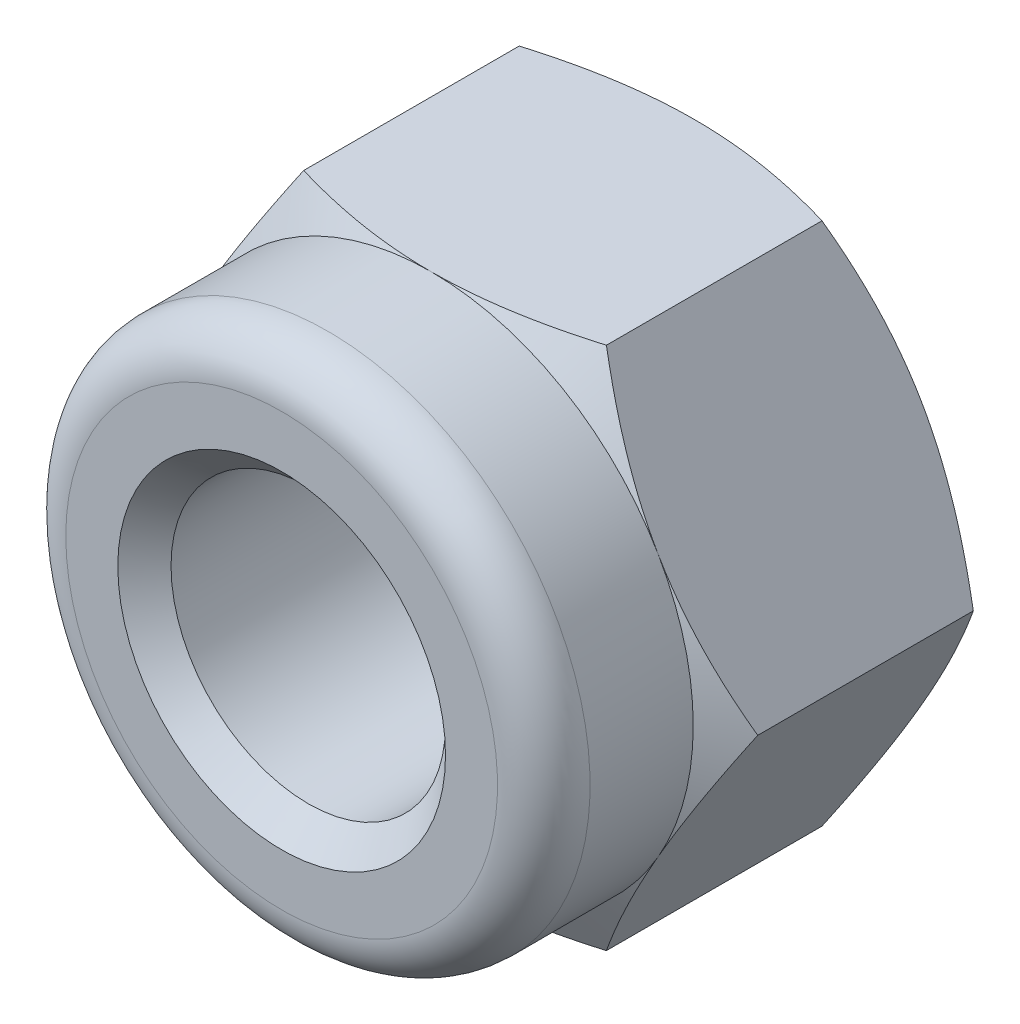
ISO-10303-21;
HEADER;
FILE_DESCRIPTION(('STEP AP214'),'2;1');
FILE_NAME('part.step','',(''),(''),'','','');
FILE_SCHEMA(('AUTOMOTIVE_DESIGN { 1 0 10303 214 1 1 1 1 }'));
ENDSEC;
DATA;
#1=APPLICATION_CONTEXT('core data for automotive mechanical design processes');
#2=APPLICATION_PROTOCOL_DEFINITION('international standard','automotive_design',2000,#1);
#3=PRODUCT_CONTEXT('',#1,'mechanical');
#4=PRODUCT('Part','Part','',(#3));
#5=PRODUCT_RELATED_PRODUCT_CATEGORY('part','',(#4));
#6=PRODUCT_DEFINITION_FORMATION('','',#4);
#7=PRODUCT_DEFINITION_CONTEXT('part definition',#1,'design');
#8=PRODUCT_DEFINITION('design','',#6,#7);
#9=PRODUCT_DEFINITION_SHAPE('','',#8);
#10=(LENGTH_UNIT() NAMED_UNIT(*) SI_UNIT(.MILLI.,.METRE.));
#11=(NAMED_UNIT(*) PLANE_ANGLE_UNIT() SI_UNIT($,.RADIAN.));
#12=(NAMED_UNIT(*) SI_UNIT($,.STERADIAN.) SOLID_ANGLE_UNIT());
#13=UNCERTAINTY_MEASURE_WITH_UNIT(LENGTH_MEASURE(1.E-05),#10,'distance_accuracy_value','');
#14=(GEOMETRIC_REPRESENTATION_CONTEXT(3) GLOBAL_UNCERTAINTY_ASSIGNED_CONTEXT((#13)) GLOBAL_UNIT_ASSIGNED_CONTEXT((#10,
#11,#12)) REPRESENTATION_CONTEXT('',''));
#15=CARTESIAN_POINT('',(0.,0.,0.));
#16=DIRECTION('',(0.,0.,1.));
#17=DIRECTION('',(1.,0.,0.));
#18=AXIS2_PLACEMENT_3D('',#15,#16,#17);
#19=CARTESIAN_POINT('',(-9.23760430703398,0.,8.04));
#20=DIRECTION('',(0.86602540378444,-0.499999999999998,0.));
#21=DIRECTION('',(0.499999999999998,0.86602540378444,0.));
#22=AXIS2_PLACEMENT_3D('',#19,#20,#21);
#23=PLANE('',#22);
#24=CARTESIAN_POINT('',(-9.23771977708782,-0.000199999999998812,7.30902271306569));
#25=CARTESIAN_POINT('',(-9.13598478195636,0.176010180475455,7.3690958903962));
#26=CARTESIAN_POINT('',(-9.03385362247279,0.352906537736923,7.42644748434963));
#27=CARTESIAN_POINT('',(-8.82872310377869,0.708203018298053,7.53494772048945));
#28=CARTESIAN_POINT('',(-8.72572337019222,0.886603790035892,7.5860935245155));
#29=CARTESIAN_POINT('',(-8.41499272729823,1.42480505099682,7.72921182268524));
#30=CARTESIAN_POINT('',(-8.20597720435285,1.7868305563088,7.81059421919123));
#31=CARTESIAN_POINT('',(-7.89322428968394,2.32853449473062,7.90585741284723));
#32=CARTESIAN_POINT('',(-7.79046603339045,2.50651701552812,7.93295207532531));
#33=CARTESIAN_POINT('',(-7.58446450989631,2.86332212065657,7.9783247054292));
#34=CARTESIAN_POINT('',(-7.48122128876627,3.04214462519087,7.996603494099));
#35=CARTESIAN_POINT('',(-7.27455287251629,3.40010482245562,8.023871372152));
#36=CARTESIAN_POINT('',(-7.17112804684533,3.57924187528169,8.03287163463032));
#37=CARTESIAN_POINT('',(-6.96418233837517,3.93768235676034,8.04138761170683));
#38=CARTESIAN_POINT('',(-6.86066145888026,4.11698577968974,8.04090364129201));
#39=CARTESIAN_POINT('',(-6.66763536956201,4.45131677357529,8.03116637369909));
#40=CARTESIAN_POINT('',(-6.5781147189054,4.60637108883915,8.02309933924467));
#41=CARTESIAN_POINT('',(-6.39929498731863,4.91609594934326,8.00003353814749));
#42=CARTESIAN_POINT('',(-6.30999592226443,5.07076646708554,7.98503428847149));
#43=CARTESIAN_POINT('',(-6.04246120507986,5.53415019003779,7.9299942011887));
#44=CARTESIAN_POINT('',(-5.86472281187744,5.84200211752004,7.8799184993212));
#45=CARTESIAN_POINT('',(-5.50728157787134,6.46110849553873,7.75491484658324));
#46=CARTESIAN_POINT('',(-5.32762833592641,6.77227703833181,7.67943904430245));
#47=CARTESIAN_POINT('',(-4.97111300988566,7.38977969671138,7.50831016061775));
#48=CARTESIAN_POINT('',(-4.79424593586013,7.69612245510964,7.41269898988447));
#49=CARTESIAN_POINT('',(-4.61868668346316,8.00020000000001,7.30902271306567));
#50=B_SPLINE_CURVE_WITH_KNOTS('',3,(#24,#25,#26,#27,#28,#29,#30,#31,#32,#33,#34,#35,#36,#37,#38,
#39,#40,#41,#42,#43,#44,#45,#46,#47,#48,#49),.UNSPECIFIED.,.F.,.F.,(4,2,2,2,2,2,2,2,2,2,2,2,4),
(0.,0.636405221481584,1.27310040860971,2.54928759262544,3.17101982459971,3.79269414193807,
4.41361896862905,5.03452317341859,5.57205298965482,6.10962026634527,7.18556169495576,
8.28638054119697,9.38493034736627),.UNSPECIFIED.);
#51=CARTESIAN_POINT('',(-9.23760430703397,0.,7.3090909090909));
#52=VERTEX_POINT('',#51);
#53=CARTESIAN_POINT('',(-6.92820323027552,3.99999999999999,8.04));
#54=VERTEX_POINT('',#53);
#55=EDGE_CURVE('E140',#52,#54,#50,.T.);
#56=ORIENTED_EDGE('',*,*,#55,.T.);
#57=CARTESIAN_POINT('',(-4.61880215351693,8.00000000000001,7.3090909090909));
#58=VERTEX_POINT('',#57);
#59=EDGE_CURVE('E212',#54,#58,#50,.T.);
#60=ORIENTED_EDGE('',*,*,#59,.T.);
#61=DIRECTION('',(0.,0.,-1.));
#62=VECTOR('',#61,1.);
#63=CARTESIAN_POINT('',(-4.618802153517,8.00000000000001,8.04));
#64=LINE('',#63,#62);
#65=CARTESIAN_POINT('',(-4.618802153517,8.00000000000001,0.730909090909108));
#66=VERTEX_POINT('',#65);
#67=EDGE_CURVE('E284',#58,#66,#64,.T.);
#68=ORIENTED_EDGE('',*,*,#67,.T.);
#69=CARTESIAN_POINT('',(-4.61868668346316,8.00020000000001,0.730977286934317));
#70=CARTESIAN_POINT('',(-4.72042167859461,7.82398981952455,0.670904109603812));
#71=CARTESIAN_POINT('',(-4.82255283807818,7.64709346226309,0.613552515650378));
#72=CARTESIAN_POINT('',(-5.02768335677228,7.29179698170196,0.505052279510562));
#73=CARTESIAN_POINT('',(-5.13068309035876,7.11339620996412,0.453906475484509));
#74=CARTESIAN_POINT('',(-5.44141373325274,6.57519494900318,0.310788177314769));
#75=CARTESIAN_POINT('',(-5.65042925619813,6.2131694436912,0.229405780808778));
#76=CARTESIAN_POINT('',(-5.96318217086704,5.67146550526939,0.134142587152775));
#77=CARTESIAN_POINT('',(-6.06594042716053,5.49348298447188,0.107047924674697));
#78=CARTESIAN_POINT('',(-6.27194195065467,5.13667787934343,0.0616752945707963));
#79=CARTESIAN_POINT('',(-6.37518517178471,4.95785537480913,0.0433965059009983));
#80=CARTESIAN_POINT('',(-6.58185358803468,4.59989517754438,0.0161286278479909));
#81=CARTESIAN_POINT('',(-6.68527841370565,4.42075812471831,0.00712836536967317));
#82=CARTESIAN_POINT('',(-6.89222412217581,4.06231764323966,-0.00138761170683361));
#83=CARTESIAN_POINT('',(-6.99574500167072,3.88301422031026,-0.000903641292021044));
#84=CARTESIAN_POINT('',(-7.18877109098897,3.54868322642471,0.00883362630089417));
#85=CARTESIAN_POINT('',(-7.27829174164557,3.39362891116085,0.016900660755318));
#86=CARTESIAN_POINT('',(-7.45711147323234,3.08390405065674,0.0399664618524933));
#87=CARTESIAN_POINT('',(-7.54641053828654,2.92923353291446,0.0549657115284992));
#88=CARTESIAN_POINT('',(-7.81394525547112,2.46584980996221,0.110005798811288));
#89=CARTESIAN_POINT('',(-7.99168364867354,2.15799788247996,0.160081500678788));
#90=CARTESIAN_POINT('',(-8.34912488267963,1.53889150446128,0.285085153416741));
#91=CARTESIAN_POINT('',(-8.52877812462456,1.2277229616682,0.360560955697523));
#92=CARTESIAN_POINT('',(-8.88529345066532,0.610220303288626,0.531689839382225));
#93=CARTESIAN_POINT('',(-9.06216052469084,0.303877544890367,0.627301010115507));
#94=CARTESIAN_POINT('',(-9.23771977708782,-0.000199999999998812,0.730977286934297));
#95=B_SPLINE_CURVE_WITH_KNOTS('',3,(#69,#70,#71,#72,#73,#74,#75,#76,#77,#78,#79,#80,#81,#82,#83,
#84,#85,#86,#87,#88,#89,#90,#91,#92,#93,#94),.UNSPECIFIED.,.F.,.F.,(4,2,2,2,2,2,2,2,2,2,2,2,4),
(0.,0.636405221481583,1.27310040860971,2.54928759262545,3.17101982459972,3.79269414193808,
4.41361896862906,5.03452317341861,5.57205298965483,6.10962026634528,7.18556169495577,
8.28638054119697,9.38493034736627),.UNSPECIFIED.);
#96=CARTESIAN_POINT('',(-6.92820323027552,3.99999999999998,0.));
#97=VERTEX_POINT('',#96);
#98=EDGE_CURVE('E283',#66,#97,#95,.T.);
#99=ORIENTED_EDGE('',*,*,#98,.T.);
#100=CARTESIAN_POINT('',(-9.23760430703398,0.,0.730909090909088));
#101=VERTEX_POINT('',#100);
#102=EDGE_CURVE('E278',#97,#101,#95,.T.);
#103=ORIENTED_EDGE('',*,*,#102,.T.);
#104=DIRECTION('',(0.,0.,-1.));
#105=VECTOR('',#104,1.);
#106=CARTESIAN_POINT('',(-9.23760430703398,0.,8.04));
#107=LINE('',#106,#105);
#108=EDGE_CURVE('E215',#52,#101,#107,.T.);
#109=ORIENTED_EDGE('',*,*,#108,.F.);
#110=EDGE_LOOP('',(#56,#60,#68,#99,#103,#109));
#111=FACE_BOUND('',#110,.T.);
#112=ADVANCED_FACE('F30',(#111),#23,.F.);
#113=CARTESIAN_POINT('',(-4.61880215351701,-8.,8.04));
#114=DIRECTION('',(0.866025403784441,0.499999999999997,0.));
#115=DIRECTION('',(-0.499999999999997,0.866025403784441,0.));
#116=AXIS2_PLACEMENT_3D('',#113,#114,#115);
#117=PLANE('',#116);
#118=CARTESIAN_POINT('',(-4.61868668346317,-8.0002,7.30902271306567));
#119=CARTESIAN_POINT('',(-4.72042167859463,-7.82398981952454,7.36909589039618));
#120=CARTESIAN_POINT('',(-4.8225528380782,-7.64709346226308,7.42644748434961));
#121=CARTESIAN_POINT('',(-5.02768335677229,-7.29179698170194,7.53494772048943));
#122=CARTESIAN_POINT('',(-5.13068309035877,-7.11339620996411,7.58609352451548));
#123=CARTESIAN_POINT('',(-5.44141373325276,-6.57519494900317,7.72921182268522));
#124=CARTESIAN_POINT('',(-5.65042925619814,-6.21316944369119,7.81059421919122));
#125=CARTESIAN_POINT('',(-5.96318217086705,-5.67146550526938,7.90585741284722));
#126=CARTESIAN_POINT('',(-6.06594042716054,-5.49348298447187,7.93295207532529));
#127=CARTESIAN_POINT('',(-6.27194195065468,-5.13667787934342,7.97832470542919));
#128=CARTESIAN_POINT('',(-6.37518517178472,-4.95785537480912,7.99660349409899));
#129=CARTESIAN_POINT('',(-6.58185358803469,-4.59989517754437,8.023871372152));
#130=CARTESIAN_POINT('',(-6.68527841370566,-4.4207581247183,8.03287163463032));
#131=CARTESIAN_POINT('',(-6.89222412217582,-4.06231764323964,8.04138761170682));
#132=CARTESIAN_POINT('',(-6.99574500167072,-3.88301422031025,8.04090364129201));
#133=CARTESIAN_POINT('',(-7.18877109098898,-3.5486832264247,8.03116637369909));
#134=CARTESIAN_POINT('',(-7.27829174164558,-3.39362891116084,8.02309933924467));
#135=CARTESIAN_POINT('',(-7.45711147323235,-3.08390405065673,8.0000335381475));
#136=CARTESIAN_POINT('',(-7.54641053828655,-2.92923353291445,7.98503428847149));
#137=CARTESIAN_POINT('',(-7.81394525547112,-2.4658498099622,7.9299942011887));
#138=CARTESIAN_POINT('',(-7.99168364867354,-2.15799788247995,7.8799184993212));
#139=CARTESIAN_POINT('',(-8.34912488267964,-1.53889150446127,7.75491484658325));
#140=CARTESIAN_POINT('',(-8.52877812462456,-1.22772296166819,7.67943904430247));
#141=CARTESIAN_POINT('',(-8.88529345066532,-0.610220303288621,7.50831016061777));
#142=CARTESIAN_POINT('',(-9.06216052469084,-0.303877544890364,7.41269898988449));
#143=CARTESIAN_POINT('',(-9.23771977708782,0.000199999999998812,7.30902271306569));
#144=B_SPLINE_CURVE_WITH_KNOTS('',3,(#118,#119,#120,#121,#122,#123,#124,#125,#126,#127,#128,
#129,#130,#131,#132,#133,#134,#135,#136,#137,#138,#139,#140,#141,#142,#143),.UNSPECIFIED.,.F.,
.F.,(4,2,2,2,2,2,2,2,2,2,2,2,4),(0.,0.636405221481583,1.27310040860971,2.54928759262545,
3.17101982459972,3.79269414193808,4.41361896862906,5.03452317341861,5.57205298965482,
6.10962026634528,7.18556169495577,8.28638054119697,9.38493034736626),.UNSPECIFIED.);
#145=CARTESIAN_POINT('',(-4.61880215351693,-8.00000000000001,7.3090909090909));
#146=VERTEX_POINT('',#145);
#147=CARTESIAN_POINT('',(-6.92820323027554,-3.99999999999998,8.04));
#148=VERTEX_POINT('',#147);
#149=EDGE_CURVE('E122',#146,#148,#144,.T.);
#150=ORIENTED_EDGE('',*,*,#149,.T.);
#151=EDGE_CURVE('E125',#148,#52,#144,.T.);
#152=ORIENTED_EDGE('',*,*,#151,.T.);
#153=ORIENTED_EDGE('',*,*,#108,.T.);
#154=CARTESIAN_POINT('',(-9.23771977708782,0.000199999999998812,0.730977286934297));
#155=CARTESIAN_POINT('',(-9.13598478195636,-0.176010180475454,0.670904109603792));
#156=CARTESIAN_POINT('',(-9.03385362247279,-0.352906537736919,0.613552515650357));
#157=CARTESIAN_POINT('',(-8.82872310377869,-0.708203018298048,0.505052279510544));
#158=CARTESIAN_POINT('',(-8.72572337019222,-0.886603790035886,0.453906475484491));
#159=CARTESIAN_POINT('',(-8.41499272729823,-1.42480505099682,0.310788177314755));
#160=CARTESIAN_POINT('',(-8.20597720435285,-1.7868305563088,0.229405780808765));
#161=CARTESIAN_POINT('',(-7.89322428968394,-2.32853449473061,0.134142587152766));
#162=CARTESIAN_POINT('',(-7.79046603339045,-2.50651701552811,0.107047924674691));
#163=CARTESIAN_POINT('',(-7.58446450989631,-2.86332212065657,0.061675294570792));
#164=CARTESIAN_POINT('',(-7.48122128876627,-3.04214462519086,0.0433965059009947));
#165=CARTESIAN_POINT('',(-7.2745528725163,-3.40010482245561,0.016128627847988));
#166=CARTESIAN_POINT('',(-7.17112804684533,-3.57924187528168,0.00712836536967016));
#167=CARTESIAN_POINT('',(-6.96418233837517,-3.93768235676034,-0.00138761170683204));
#168=CARTESIAN_POINT('',(-6.86066145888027,-4.11698577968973,-0.000903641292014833));
#169=CARTESIAN_POINT('',(-6.66763536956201,-4.45131677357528,0.00883362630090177));
#170=CARTESIAN_POINT('',(-6.57811471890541,-4.60637108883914,0.0169006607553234));
#171=CARTESIAN_POINT('',(-6.39929498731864,-4.91609594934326,0.0399664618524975));
#172=CARTESIAN_POINT('',(-6.30999592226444,-5.07076646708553,0.0549657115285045));
#173=CARTESIAN_POINT('',(-6.04246120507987,-5.53415019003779,0.110005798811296));
#174=CARTESIAN_POINT('',(-5.86472281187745,-5.84200211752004,0.160081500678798));
#175=CARTESIAN_POINT('',(-5.50728157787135,-6.46110849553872,0.285085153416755));
#176=CARTESIAN_POINT('',(-5.32762833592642,-6.7722770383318,0.360560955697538));
#177=CARTESIAN_POINT('',(-4.97111300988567,-7.38977969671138,0.531689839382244));
#178=CARTESIAN_POINT('',(-4.79424593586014,-7.69612245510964,0.627301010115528));
#179=CARTESIAN_POINT('',(-4.61868668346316,-8.0002,0.730977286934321));
#180=B_SPLINE_CURVE_WITH_KNOTS('',3,(#154,#155,#156,#157,#158,#159,#160,#161,#162,#163,#164,
#165,#166,#167,#168,#169,#170,#171,#172,#173,#174,#175,#176,#177,#178,#179),.UNSPECIFIED.,.F.,
.F.,(4,2,2,2,2,2,2,2,2,2,2,2,4),(0.,0.63640522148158,1.2731004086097,2.54928759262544,
3.17101982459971,3.79269414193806,4.41361896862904,5.03452317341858,5.57205298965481,
6.10962026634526,7.18556169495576,8.28638054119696,9.38493034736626),.UNSPECIFIED.);
#181=CARTESIAN_POINT('',(-6.92820323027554,-3.99999999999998,0.));
#182=VERTEX_POINT('',#181);
#183=EDGE_CURVE('E272',#101,#182,#180,.T.);
#184=ORIENTED_EDGE('',*,*,#183,.T.);
#185=CARTESIAN_POINT('',(-4.61880215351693,-8.00000000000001,0.730909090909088));
#186=VERTEX_POINT('',#185);
#187=EDGE_CURVE('E266',#182,#186,#180,.T.);
#188=ORIENTED_EDGE('',*,*,#187,.T.);
#189=DIRECTION('',(0.,0.,-1.));
#190=VECTOR('',#189,1.);
#191=CARTESIAN_POINT('',(-4.61880215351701,-8.,8.04));
#192=LINE('',#191,#190);
#193=EDGE_CURVE('E128',#146,#186,#192,.T.);
#194=ORIENTED_EDGE('',*,*,#193,.F.);
#195=EDGE_LOOP('',(#150,#152,#153,#184,#188,#194));
#196=FACE_BOUND('',#195,.T.);
#197=ADVANCED_FACE('F124',(#196),#117,.F.);
#198=CARTESIAN_POINT('',(4.618802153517,-8.,8.04));
#199=DIRECTION('',(0.,1.,0.));
#200=DIRECTION('',(-1.,0.,0.));
#201=AXIS2_PLACEMENT_3D('',#198,#199,#200);
#202=PLANE('',#201);
#203=CARTESIAN_POINT('',(-12.2494480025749,-8.,4.1241854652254));
#204=CARTESIAN_POINT('',(-11.8988966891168,-8.,4.29747281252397));
#205=CARTESIAN_POINT('',(-11.5474876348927,-7.99999999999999,4.46905638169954));
#206=CARTESIAN_POINT('',(-10.8424887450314,-7.99999999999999,4.80784022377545));
#207=CARTESIAN_POINT('',(-10.4888985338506,-7.99999999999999,4.97503971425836));
#208=CARTESIAN_POINT('',(-9.77708168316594,-7.99999999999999,5.30499759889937));
#209=CARTESIAN_POINT('',(-9.41883997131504,-7.99999999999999,5.46772359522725));
#210=CARTESIAN_POINT('',(-8.69930316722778,-7.99999999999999,5.78625102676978));
#211=CARTESIAN_POINT('',(-8.33800824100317,-8.,5.94205283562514));
#212=CARTESIAN_POINT('',(-7.6068605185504,-8.,6.24690528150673));
#213=CARTESIAN_POINT('',(-7.23695794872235,-8.,6.39583720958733));
#214=CARTESIAN_POINT('',(-6.49261235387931,-8.,6.68211017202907));
#215=CARTESIAN_POINT('',(-6.11816880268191,-8.,6.8194498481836));
#216=CARTESIAN_POINT('',(-5.36490469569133,-8.,7.07882342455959));
#217=CARTESIAN_POINT('',(-4.98609591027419,-7.99999999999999,7.20089113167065));
#218=CARTESIAN_POINT('',(-4.22286609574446,-8.,7.42573868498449));
#219=CARTESIAN_POINT('',(-3.83844697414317,-8.00000000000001,7.52852492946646));
#220=CARTESIAN_POINT('',(-3.06363739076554,-8.00000000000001,7.70975510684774));
#221=CARTESIAN_POINT('',(-2.67324528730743,-8.,7.78819221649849));
#222=CARTESIAN_POINT('',(-2.08406130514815,-8.,7.88359074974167));
#223=CARTESIAN_POINT('',(-1.88704386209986,-8.,7.91168274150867));
#224=CARTESIAN_POINT('',(-1.49204151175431,-8.,7.95988434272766));
#225=CARTESIAN_POINT('',(-1.29405670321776,-8.,7.97999475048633));
#226=CARTESIAN_POINT('',(-0.89875005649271,-8.,8.01167549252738));
#227=CARTESIAN_POINT('',(-0.701432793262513,-8.,8.02330267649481));
#228=CARTESIAN_POINT('',(-0.306479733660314,-8.,8.03796692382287));
#229=CARTESIAN_POINT('',(-0.108843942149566,-8.,8.04100411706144));
#230=CARTESIAN_POINT('',(0.286318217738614,-8.,8.03841459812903));
#231=CARTESIAN_POINT('',(0.48384460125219,-8.,8.03279022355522));
#232=CARTESIAN_POINT('',(0.878473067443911,-8.,8.01301944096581));
#233=CARTESIAN_POINT('',(1.0755751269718,-8.00000000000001,7.99887257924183));
#234=CARTESIAN_POINT('',(1.54507610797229,-8.00000000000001,7.95531775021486));
#235=CARTESIAN_POINT('',(1.81712981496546,-8.,7.92212443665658));
#236=CARTESIAN_POINT('',(2.35907056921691,-8.,7.84129845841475));
#237=CARTESIAN_POINT('',(2.62895731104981,-8.,7.79366379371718));
#238=CARTESIAN_POINT('',(3.43581091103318,-8.,7.63139306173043));
#239=CARTESIAN_POINT('',(3.96895108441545,-8.,7.49749627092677));
#240=CARTESIAN_POINT('',(4.7664231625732,-8.,7.26673981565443));
#241=CARTESIAN_POINT('',(5.03498549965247,-8.,7.18368674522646));
#242=CARTESIAN_POINT('',(5.56946017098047,-8.,7.00930187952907));
#243=CARTESIAN_POINT('',(5.8353722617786,-8.,6.91796933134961));
#244=CARTESIAN_POINT('',(6.36324568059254,-8.,6.72894447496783));
#245=CARTESIAN_POINT('',(6.62522071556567,-8.,6.63129006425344));
#246=CARTESIAN_POINT('',(7.14687665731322,-8.,6.4302871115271));
#247=CARTESIAN_POINT('',(7.40655833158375,-8.,6.32694056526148));
#248=CARTESIAN_POINT('',(7.66526843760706,-8.00000000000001,6.22126991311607));
#249=B_SPLINE_CURVE_WITH_KNOTS('',3,(#203,#204,#205,#206,#207,#208,#209,#210,#211,#212,#213,
#214,#215,#216,#217,#218,#219,#220,#221,#222,#223,#224,#225,#226,#227,#228,#229,#230,#231,#232,
#233,#234,#235,#236,#237,#238,#239,#240,#241,#242,#243,#244,#245,#246,#247,#248),.UNSPECIFIED.,
.F.,.F.,(4,2,2,2,2,2,2,2,2,2,2,2,2,2,2,2,2,2,2,2,2,2,4),(0.,1.17314553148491,2.34649902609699,
3.52684382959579,4.70712486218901,5.90325054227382,7.09951617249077,8.29308497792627,
9.48625701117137,10.6797631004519,11.2766571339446,11.8734914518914,12.4662884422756,
13.0590764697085,13.6517045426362,14.2443641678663,15.0661167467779,15.8879831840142,
17.5347791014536,18.3780442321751,19.221386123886,20.0600717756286,20.898465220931),.UNSPECIFIED.);
#250=CARTESIAN_POINT('',(4.61880215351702,-7.99999999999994,7.3090909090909));
#251=VERTEX_POINT('',#250);
#252=CARTESIAN_POINT('',(0.,-8.,8.04));
#253=VERTEX_POINT('',#252);
#254=EDGE_CURVE('E357',#251,#253,#249,.F.);
#255=ORIENTED_EDGE('',*,*,#254,.T.);
#256=EDGE_CURVE('E145',#253,#146,#249,.F.);
#257=ORIENTED_EDGE('',*,*,#256,.T.);
#258=ORIENTED_EDGE('',*,*,#193,.T.);
#259=CARTESIAN_POINT('',(-12.2494480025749,-7.99999999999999,3.91581453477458));
#260=CARTESIAN_POINT('',(-11.8988966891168,-7.99999999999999,3.74252718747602));
#261=CARTESIAN_POINT('',(-11.5474876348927,-7.99999999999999,3.57094361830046));
#262=CARTESIAN_POINT('',(-10.8424887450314,-7.99999999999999,3.23215977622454));
#263=CARTESIAN_POINT('',(-10.4888985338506,-7.99999999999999,3.06496028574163));
#264=CARTESIAN_POINT('',(-9.77708168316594,-7.99999999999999,2.73500240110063));
#265=CARTESIAN_POINT('',(-9.41883997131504,-7.99999999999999,2.57227640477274));
#266=CARTESIAN_POINT('',(-8.69930316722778,-7.99999999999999,2.25374897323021));
#267=CARTESIAN_POINT('',(-8.33800824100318,-8.,2.09794716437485));
#268=CARTESIAN_POINT('',(-7.60686051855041,-8.,1.79309471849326));
#269=CARTESIAN_POINT('',(-7.23695794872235,-8.,1.64416279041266));
#270=CARTESIAN_POINT('',(-6.49261235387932,-8.,1.35788982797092));
#271=CARTESIAN_POINT('',(-6.11816880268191,-8.,1.22055015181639));
#272=CARTESIAN_POINT('',(-5.36490469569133,-8.,0.961176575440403));
#273=CARTESIAN_POINT('',(-4.98609591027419,-8.,0.83910886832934));
#274=CARTESIAN_POINT('',(-4.22286609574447,-7.99999999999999,0.614261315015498));
#275=CARTESIAN_POINT('',(-3.83844697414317,-7.99999999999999,0.511475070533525));
#276=CARTESIAN_POINT('',(-3.06363739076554,-7.99999999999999,0.330244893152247));
#277=CARTESIAN_POINT('',(-2.67324528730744,-8.,0.251807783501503));
#278=CARTESIAN_POINT('',(-2.08406130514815,-8.,0.15640925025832));
#279=CARTESIAN_POINT('',(-1.88704386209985,-8.,0.128317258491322));
#280=CARTESIAN_POINT('',(-1.49204151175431,-8.,0.0801156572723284));
#281=CARTESIAN_POINT('',(-1.29405670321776,-8.,0.0600052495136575));
#282=CARTESIAN_POINT('',(-0.898750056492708,-8.,0.0283245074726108));
#283=CARTESIAN_POINT('',(-0.701432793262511,-8.,0.0166973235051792));
#284=CARTESIAN_POINT('',(-0.306479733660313,-8.,0.00203307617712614));
#285=CARTESIAN_POINT('',(-0.108843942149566,-8.,-0.00100411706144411));
#286=CARTESIAN_POINT('',(0.286318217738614,-8.,0.00158540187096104));
#287=CARTESIAN_POINT('',(0.48384460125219,-8.,0.00720977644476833));
#288=CARTESIAN_POINT('',(0.878473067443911,-8.,0.0269805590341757));
#289=CARTESIAN_POINT('',(1.0755751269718,-8.00000000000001,0.0411274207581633));
#290=CARTESIAN_POINT('',(1.54507610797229,-8.00000000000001,0.0846822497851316));
#291=CARTESIAN_POINT('',(1.81712981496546,-8.,0.117875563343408));
#292=CARTESIAN_POINT('',(2.35907056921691,-8.,0.198701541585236));
#293=CARTESIAN_POINT('',(2.62895731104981,-8.,0.24633620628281));
#294=CARTESIAN_POINT('',(3.43581091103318,-8.,0.408606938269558));
#295=CARTESIAN_POINT('',(3.96895108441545,-8.,0.542503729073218));
#296=CARTESIAN_POINT('',(4.7664231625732,-8.,0.773260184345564));
#297=CARTESIAN_POINT('',(5.03498549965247,-8.,0.856313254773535));
#298=CARTESIAN_POINT('',(5.56946017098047,-8.,1.03069812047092));
#299=CARTESIAN_POINT('',(5.8353722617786,-8.,1.12203066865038));
#300=CARTESIAN_POINT('',(6.36324568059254,-8.,1.31105552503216));
#301=CARTESIAN_POINT('',(6.62522071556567,-8.,1.40870993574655));
#302=CARTESIAN_POINT('',(7.14687665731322,-8.,1.60971288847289));
#303=CARTESIAN_POINT('',(7.40655833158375,-8.,1.71305943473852));
#304=CARTESIAN_POINT('',(7.66526843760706,-8.,1.81873008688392));
#305=B_SPLINE_CURVE_WITH_KNOTS('',3,(#259,#260,#261,#262,#263,#264,#265,#266,#267,#268,#269,
#270,#271,#272,#273,#274,#275,#276,#277,#278,#279,#280,#281,#282,#283,#284,#285,#286,#287,#288,
#289,#290,#291,#292,#293,#294,#295,#296,#297,#298,#299,#300,#301,#302,#303,#304),.UNSPECIFIED.,
.F.,.F.,(4,2,2,2,2,2,2,2,2,2,2,2,2,2,2,2,2,2,2,2,2,2,4),(0.,1.17314553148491,2.34649902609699,
3.52684382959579,4.707124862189,5.90325054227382,7.09951617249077,8.29308497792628,
9.48625701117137,10.6797631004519,11.2766571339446,11.8734914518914,12.4662884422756,
13.0590764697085,13.6517045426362,14.2443641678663,15.0661167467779,15.8879831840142,
17.5347791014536,18.3780442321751,19.221386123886,20.0600717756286,20.898465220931),.UNSPECIFIED.);
#306=CARTESIAN_POINT('',(0.,-8.,0.));
#307=VERTEX_POINT('',#306);
#308=EDGE_CURVE('E273',#186,#307,#305,.T.);
#309=ORIENTED_EDGE('',*,*,#308,.T.);
#310=CARTESIAN_POINT('',(4.61880215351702,-7.99999999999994,0.730909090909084));
#311=VERTEX_POINT('',#310);
#312=EDGE_CURVE('E53',#307,#311,#305,.T.);
#313=ORIENTED_EDGE('',*,*,#312,.T.);
#314=DIRECTION('',(0.,0.,-1.));
#315=VECTOR('',#314,1.);
#316=CARTESIAN_POINT('',(4.618802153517,-8.,8.04));
#317=LINE('',#316,#315);
#318=EDGE_CURVE('E290',#251,#311,#317,.T.);
#319=ORIENTED_EDGE('',*,*,#318,.F.);
#320=EDGE_LOOP('',(#255,#257,#258,#309,#313,#319));
#321=FACE_BOUND('',#320,.T.);
#322=ADVANCED_FACE('F210',(#321),#202,.F.);
#323=CARTESIAN_POINT('',(9.23760430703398,0.,8.04));
#324=DIRECTION('',(-0.86602540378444,0.499999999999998,0.));
#325=DIRECTION('',(-0.499999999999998,-0.86602540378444,0.));
#326=AXIS2_PLACEMENT_3D('',#323,#324,#325);
#327=PLANE('',#326);
#328=CARTESIAN_POINT('',(9.23771977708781,0.000200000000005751,7.30902271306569));
#329=CARTESIAN_POINT('',(9.13598478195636,-0.176010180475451,7.3690958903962));
#330=CARTESIAN_POINT('',(9.03385362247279,-0.352906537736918,7.42644748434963));
#331=CARTESIAN_POINT('',(8.82872310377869,-0.708203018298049,7.53494772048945));
#332=CARTESIAN_POINT('',(8.72572337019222,-0.886603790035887,7.5860935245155));
#333=CARTESIAN_POINT('',(8.41499272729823,-1.42480505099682,7.72921182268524));
#334=CARTESIAN_POINT('',(8.20597720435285,-1.7868305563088,7.81059421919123));
#335=CARTESIAN_POINT('',(7.89322428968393,-2.32853449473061,7.90585741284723));
#336=CARTESIAN_POINT('',(7.79046603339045,-2.50651701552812,7.93295207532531));
#337=CARTESIAN_POINT('',(7.5844645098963,-2.86332212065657,7.9783247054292));
#338=CARTESIAN_POINT('',(7.48122128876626,-3.04214462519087,7.996603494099));
#339=CARTESIAN_POINT('',(7.27455287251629,-3.40010482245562,8.023871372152));
#340=CARTESIAN_POINT('',(7.17112804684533,-3.57924187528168,8.03287163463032));
#341=CARTESIAN_POINT('',(6.96418233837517,-3.93768235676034,8.04138761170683));
#342=CARTESIAN_POINT('',(6.86066145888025,-4.11698577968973,8.04090364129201));
#343=CARTESIAN_POINT('',(6.667635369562,-4.45131677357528,8.03116637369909));
#344=CARTESIAN_POINT('',(6.5781147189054,-4.60637108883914,8.02309933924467));
#345=CARTESIAN_POINT('',(6.39929498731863,-4.91609594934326,8.0000335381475));
#346=CARTESIAN_POINT('',(6.30999592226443,-5.07076646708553,7.98503428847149));
#347=CARTESIAN_POINT('',(6.04246120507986,-5.53415019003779,7.9299942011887));
#348=CARTESIAN_POINT('',(5.86472281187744,-5.84200211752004,7.8799184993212));
#349=CARTESIAN_POINT('',(5.50728157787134,-6.46110849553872,7.75491484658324));
#350=CARTESIAN_POINT('',(5.32762833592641,-6.7722770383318,7.67943904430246));
#351=CARTESIAN_POINT('',(4.97111300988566,-7.38977969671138,7.50831016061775));
#352=CARTESIAN_POINT('',(4.79424593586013,-7.69612245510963,7.41269898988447));
#353=CARTESIAN_POINT('',(4.61868668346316,-8.0002,7.30902271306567));
#354=B_SPLINE_CURVE_WITH_KNOTS('',3,(#328,#329,#330,#331,#332,#333,#334,#335,#336,#337,#338,
#339,#340,#341,#342,#343,#344,#345,#346,#347,#348,#349,#350,#351,#352,#353),.UNSPECIFIED.,.F.,
.F.,(4,2,2,2,2,2,2,2,2,2,2,2,4),(0.,0.636405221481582,1.2731004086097,2.54928759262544,
3.17101982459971,3.79269414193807,4.41361896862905,5.03452317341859,5.57205298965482,
6.10962026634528,7.18556169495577,8.28638054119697,9.38493034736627),.UNSPECIFIED.);
#355=CARTESIAN_POINT('',(9.23760430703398,0.,7.3090909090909));
#356=VERTEX_POINT('',#355);
#357=CARTESIAN_POINT('',(6.92820323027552,-3.99999999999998,8.04));
#358=VERTEX_POINT('',#357);
#359=EDGE_CURVE('E141',#356,#358,#354,.T.);
#360=ORIENTED_EDGE('',*,*,#359,.T.);
#361=EDGE_CURVE('E132',#358,#251,#354,.T.);
#362=ORIENTED_EDGE('',*,*,#361,.T.);
#363=ORIENTED_EDGE('',*,*,#318,.T.);
#364=CARTESIAN_POINT('',(4.61868668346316,-8.0002,0.730977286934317));
#365=CARTESIAN_POINT('',(4.72042167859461,-7.82398981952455,0.67090410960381));
#366=CARTESIAN_POINT('',(4.82255283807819,-7.64709346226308,0.613552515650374));
#367=CARTESIAN_POINT('',(5.02768335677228,-7.29179698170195,0.505052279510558));
#368=CARTESIAN_POINT('',(5.13068309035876,-7.11339620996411,0.453906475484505));
#369=CARTESIAN_POINT('',(5.44141373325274,-6.57519494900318,0.310788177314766));
#370=CARTESIAN_POINT('',(5.65042925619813,-6.2131694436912,0.229405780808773));
#371=CARTESIAN_POINT('',(5.96318217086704,-5.67146550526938,0.134142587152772));
#372=CARTESIAN_POINT('',(6.06594042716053,-5.49348298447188,0.107047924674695));
#373=CARTESIAN_POINT('',(6.27194195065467,-5.13667787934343,0.0616752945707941));
#374=CARTESIAN_POINT('',(6.37518517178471,-4.95785537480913,0.0433965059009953));
#375=CARTESIAN_POINT('',(6.58185358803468,-4.59989517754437,0.016128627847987));
#376=CARTESIAN_POINT('',(6.68527841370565,-4.42075812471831,0.00712836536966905));
#377=CARTESIAN_POINT('',(6.89222412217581,-4.06231764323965,-0.00138761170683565));
#378=CARTESIAN_POINT('',(6.99574500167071,-3.88301422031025,-0.000903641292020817));
#379=CARTESIAN_POINT('',(7.18877109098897,-3.5486832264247,0.008833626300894));
#380=CARTESIAN_POINT('',(7.27829174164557,-3.39362891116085,0.0169006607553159));
#381=CARTESIAN_POINT('',(7.45711147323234,-3.08390405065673,0.0399664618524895));
#382=CARTESIAN_POINT('',(7.54641053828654,-2.92923353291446,0.0549657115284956));
#383=CARTESIAN_POINT('',(7.81394525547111,-2.46584980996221,0.110005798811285));
#384=CARTESIAN_POINT('',(7.99168364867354,-2.15799788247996,0.160081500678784));
#385=CARTESIAN_POINT('',(8.34912488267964,-1.53889150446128,0.285085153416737));
#386=CARTESIAN_POINT('',(8.52877812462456,-1.22772296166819,0.360560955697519));
#387=CARTESIAN_POINT('',(8.88529345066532,-0.61022030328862,0.531689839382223));
#388=CARTESIAN_POINT('',(9.06216052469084,-0.30387754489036,0.627301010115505));
#389=CARTESIAN_POINT('',(9.23771977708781,0.000200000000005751,0.730977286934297));
#390=B_SPLINE_CURVE_WITH_KNOTS('',3,(#364,#365,#366,#367,#368,#369,#370,#371,#372,#373,#374,
#375,#376,#377,#378,#379,#380,#381,#382,#383,#384,#385,#386,#387,#388,#389),.UNSPECIFIED.,.F.,
.F.,(4,2,2,2,2,2,2,2,2,2,2,2,4),(0.,0.636405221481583,1.27310040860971,2.54928759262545,
3.17101982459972,3.79269414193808,4.41361896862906,5.0345231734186,5.57205298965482,
6.10962026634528,7.18556169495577,8.28638054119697,9.38493034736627),.UNSPECIFIED.);
#391=CARTESIAN_POINT('',(6.92820323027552,-3.99999999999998,0.));
#392=VERTEX_POINT('',#391);
#393=EDGE_CURVE('E313',#311,#392,#390,.T.);
#394=ORIENTED_EDGE('',*,*,#393,.T.);
#395=CARTESIAN_POINT('',(9.23760430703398,0.,0.730909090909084));
#396=VERTEX_POINT('',#395);
#397=EDGE_CURVE('E323',#392,#396,#390,.T.);
#398=ORIENTED_EDGE('',*,*,#397,.T.);
#399=DIRECTION('',(0.,0.,-1.));
#400=VECTOR('',#399,1.);
#401=CARTESIAN_POINT('',(9.23760430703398,0.,8.04));
#402=LINE('',#401,#400);
#403=EDGE_CURVE('E288',#356,#396,#402,.T.);
#404=ORIENTED_EDGE('',*,*,#403,.F.);
#405=EDGE_LOOP('',(#360,#362,#363,#394,#398,#404));
#406=FACE_BOUND('',#405,.T.);
#407=ADVANCED_FACE('F321',(#406),#327,.F.);
#408=CARTESIAN_POINT('',(4.618802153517,8.,8.04));
#409=DIRECTION('',(-0.86602540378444,-0.499999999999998,0.));
#410=DIRECTION('',(0.499999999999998,-0.86602540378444,0.));
#411=AXIS2_PLACEMENT_3D('',#408,#409,#410);
#412=PLANE('',#411);
#413=CARTESIAN_POINT('',(4.61868668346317,8.0002,7.30902271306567));
#414=CARTESIAN_POINT('',(4.72042167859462,7.82398981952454,7.36909589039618));
#415=CARTESIAN_POINT('',(4.82255283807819,7.64709346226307,7.42644748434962));
#416=CARTESIAN_POINT('',(5.02768335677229,7.29179698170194,7.53494772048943));
#417=CARTESIAN_POINT('',(5.13068309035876,7.1133962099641,7.58609352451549));
#418=CARTESIAN_POINT('',(5.44141373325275,6.57519494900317,7.72921182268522));
#419=CARTESIAN_POINT('',(5.65042925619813,6.21316944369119,7.81059421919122));
#420=CARTESIAN_POINT('',(5.96318217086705,5.67146550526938,7.90585741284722));
#421=CARTESIAN_POINT('',(6.06594042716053,5.49348298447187,7.9329520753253));
#422=CARTESIAN_POINT('',(6.27194195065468,5.13667787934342,7.9783247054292));
#423=CARTESIAN_POINT('',(6.37518517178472,4.95785537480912,7.99660349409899));
#424=CARTESIAN_POINT('',(6.58185358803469,4.59989517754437,8.023871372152));
#425=CARTESIAN_POINT('',(6.68527841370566,4.4207581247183,8.03287163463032));
#426=CARTESIAN_POINT('',(6.89222412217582,4.06231764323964,8.04138761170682));
#427=CARTESIAN_POINT('',(6.99574500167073,3.88301422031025,8.04090364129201));
#428=CARTESIAN_POINT('',(7.18877109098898,3.5486832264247,8.03116637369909));
#429=CARTESIAN_POINT('',(7.27829174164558,3.39362891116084,8.02309933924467));
#430=CARTESIAN_POINT('',(7.45711147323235,3.08390405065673,8.0000335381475));
#431=CARTESIAN_POINT('',(7.54641053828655,2.92923353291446,7.98503428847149));
#432=CARTESIAN_POINT('',(7.81394525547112,2.46584980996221,7.9299942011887));
#433=CARTESIAN_POINT('',(7.99168364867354,2.15799788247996,7.8799184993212));
#434=CARTESIAN_POINT('',(8.34912488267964,1.53889150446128,7.75491484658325));
#435=CARTESIAN_POINT('',(8.52877812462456,1.2277229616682,7.67943904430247));
#436=CARTESIAN_POINT('',(8.88529345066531,0.610220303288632,7.50831016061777));
#437=CARTESIAN_POINT('',(9.06216052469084,0.303877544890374,7.41269898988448));
#438=CARTESIAN_POINT('',(9.2377197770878,-0.000199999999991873,7.30902271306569));
#439=B_SPLINE_CURVE_WITH_KNOTS('',3,(#413,#414,#415,#416,#417,#418,#419,#420,#421,#422,#423,
#424,#425,#426,#427,#428,#429,#430,#431,#432,#433,#434,#435,#436,#437,#438),.UNSPECIFIED.,.F.,
.F.,(4,2,2,2,2,2,2,2,2,2,2,2,4),(0.,0.636405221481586,1.27310040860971,2.54928759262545,
3.17101982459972,3.79269414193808,4.41361896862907,5.03452317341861,5.57205298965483,
6.10962026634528,7.18556169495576,8.28638054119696,9.38493034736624),.UNSPECIFIED.);
#440=CARTESIAN_POINT('',(4.618802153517,8.,7.30909090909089));
#441=VERTEX_POINT('',#440);
#442=CARTESIAN_POINT('',(6.92820323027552,3.99999999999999,8.04));
#443=VERTEX_POINT('',#442);
#444=EDGE_CURVE('E45',#441,#443,#439,.T.);
#445=ORIENTED_EDGE('',*,*,#444,.T.);
#446=EDGE_CURVE('E216',#443,#356,#439,.T.);
#447=ORIENTED_EDGE('',*,*,#446,.T.);
#448=ORIENTED_EDGE('',*,*,#403,.T.);
#449=CARTESIAN_POINT('',(9.2377197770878,-0.000199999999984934,0.730977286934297));
#450=CARTESIAN_POINT('',(9.13598478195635,0.176010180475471,0.670904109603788));
#451=CARTESIAN_POINT('',(9.03385362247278,0.352906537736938,0.613552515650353));
#452=CARTESIAN_POINT('',(8.82872310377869,0.708203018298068,0.505052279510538));
#453=CARTESIAN_POINT('',(8.72572337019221,0.886603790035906,0.453906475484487));
#454=CARTESIAN_POINT('',(8.41499272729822,1.42480505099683,0.310788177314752));
#455=CARTESIAN_POINT('',(8.20597720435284,1.78683055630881,0.229405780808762));
#456=CARTESIAN_POINT('',(7.89322428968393,2.32853449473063,0.134142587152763));
#457=CARTESIAN_POINT('',(7.79046603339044,2.50651701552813,0.107047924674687));
#458=CARTESIAN_POINT('',(7.5844645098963,2.86332212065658,0.0616752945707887));
#459=CARTESIAN_POINT('',(7.48122128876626,3.04214462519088,0.0433965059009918));
#460=CARTESIAN_POINT('',(7.27455287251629,3.40010482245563,0.0161286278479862));
#461=CARTESIAN_POINT('',(7.17112804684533,3.57924187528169,0.00712836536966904));
#462=CARTESIAN_POINT('',(6.96418233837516,3.93768235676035,-0.00138761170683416));
#463=CARTESIAN_POINT('',(6.86066145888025,4.11698577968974,-0.000903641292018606));
#464=CARTESIAN_POINT('',(6.667635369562,4.45131677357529,0.00883362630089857));
#465=CARTESIAN_POINT('',(6.5781147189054,4.60637108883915,0.016900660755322));
#466=CARTESIAN_POINT('',(6.39929498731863,4.91609594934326,0.0399664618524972));
#467=CARTESIAN_POINT('',(6.30999592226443,5.07076646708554,0.0549657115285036));
#468=CARTESIAN_POINT('',(6.04246120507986,5.53415019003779,0.110005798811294));
#469=CARTESIAN_POINT('',(5.86472281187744,5.84200211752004,0.160081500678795));
#470=CARTESIAN_POINT('',(5.50728157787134,6.46110849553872,0.285085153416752));
#471=CARTESIAN_POINT('',(5.32762833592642,6.7722770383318,0.360560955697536));
#472=CARTESIAN_POINT('',(4.97111300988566,7.38977969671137,0.531689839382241));
#473=CARTESIAN_POINT('',(4.79424593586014,7.69612245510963,0.627301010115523));
#474=CARTESIAN_POINT('',(4.61868668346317,8.0002,0.730977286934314));
#475=B_SPLINE_CURVE_WITH_KNOTS('',3,(#449,#450,#451,#452,#453,#454,#455,#456,#457,#458,#459,
#460,#461,#462,#463,#464,#465,#466,#467,#468,#469,#470,#471,#472,#473,#474),.UNSPECIFIED.,.F.,
.F.,(4,2,2,2,2,2,2,2,2,2,2,2,4),(0.,0.636405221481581,1.2731004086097,2.54928759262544,
3.1710198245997,3.79269414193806,4.41361896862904,5.03452317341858,5.5720529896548,
6.10962026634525,7.18556169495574,8.28638054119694,9.38493034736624),.UNSPECIFIED.);
#476=CARTESIAN_POINT('',(6.92820323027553,3.99999999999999,0.));
#477=VERTEX_POINT('',#476);
#478=EDGE_CURVE('E326',#396,#477,#475,.T.);
#479=ORIENTED_EDGE('',*,*,#478,.T.);
#480=CARTESIAN_POINT('',(4.61880215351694,7.99999999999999,0.730909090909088));
#481=VERTEX_POINT('',#480);
#482=EDGE_CURVE('E331',#477,#481,#475,.T.);
#483=ORIENTED_EDGE('',*,*,#482,.T.);
#484=DIRECTION('',(0.,0.,-1.));
#485=VECTOR('',#484,1.);
#486=CARTESIAN_POINT('',(4.618802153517,8.,8.04));
#487=LINE('',#486,#485);
#488=EDGE_CURVE('E286',#441,#481,#487,.T.);
#489=ORIENTED_EDGE('',*,*,#488,.F.);
#490=EDGE_LOOP('',(#445,#447,#448,#479,#483,#489));
#491=FACE_BOUND('',#490,.T.);
#492=ADVANCED_FACE('F338',(#491),#412,.F.);
#493=CARTESIAN_POINT('',(-4.618802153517,8.00000000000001,8.04));
#494=DIRECTION('',(0.,-1.,0.));
#495=DIRECTION('',(1.,0.,0.));
#496=AXIS2_PLACEMENT_3D('',#493,#494,#495);
#497=PLANE('',#496);
#498=CARTESIAN_POINT('',(-12.2494480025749,8.00000000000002,4.12418546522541));
#499=CARTESIAN_POINT('',(-11.8988966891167,8.00000000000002,4.29747281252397));
#500=CARTESIAN_POINT('',(-11.5474876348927,8.00000000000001,4.46905638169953));
#501=CARTESIAN_POINT('',(-10.8424887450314,8.00000000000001,4.80784022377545));
#502=CARTESIAN_POINT('',(-10.4888985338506,8.00000000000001,4.97503971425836));
#503=CARTESIAN_POINT('',(-9.77708168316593,8.00000000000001,5.30499759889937));
#504=CARTESIAN_POINT('',(-9.41883997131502,8.00000000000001,5.46772359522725));
#505=CARTESIAN_POINT('',(-8.69930316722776,8.00000000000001,5.78625102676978));
#506=CARTESIAN_POINT('',(-8.33800824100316,8.00000000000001,5.94205283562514));
#507=CARTESIAN_POINT('',(-7.60686051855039,8.00000000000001,6.24690528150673));
#508=CARTESIAN_POINT('',(-7.23695794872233,8.00000000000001,6.39583720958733));
#509=CARTESIAN_POINT('',(-6.4926123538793,8.00000000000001,6.68211017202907));
#510=CARTESIAN_POINT('',(-6.11816880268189,8.00000000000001,6.8194498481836));
#511=CARTESIAN_POINT('',(-5.36490469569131,8.00000000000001,7.07882342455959));
#512=CARTESIAN_POINT('',(-4.98609591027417,8.00000000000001,7.20089113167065));
#513=CARTESIAN_POINT('',(-4.22286609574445,8.00000000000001,7.42573868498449));
#514=CARTESIAN_POINT('',(-3.83844697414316,8.00000000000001,7.52852492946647));
#515=CARTESIAN_POINT('',(-3.06363739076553,8.00000000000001,7.70975510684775));
#516=CARTESIAN_POINT('',(-2.67324528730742,8.,7.78819221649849));
#517=CARTESIAN_POINT('',(-2.08406130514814,8.,7.88359074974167));
#518=CARTESIAN_POINT('',(-1.88704386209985,8.,7.91168274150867));
#519=CARTESIAN_POINT('',(-1.4920415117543,8.,7.95988434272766));
#520=CARTESIAN_POINT('',(-1.29405670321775,8.,7.97999475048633));
#521=CARTESIAN_POINT('',(-0.898750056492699,8.,8.01167549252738));
#522=CARTESIAN_POINT('',(-0.701432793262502,8.,8.02330267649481));
#523=CARTESIAN_POINT('',(-0.306479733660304,8.,8.03796692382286));
#524=CARTESIAN_POINT('',(-0.108843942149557,8.,8.04100411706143));
#525=CARTESIAN_POINT('',(0.286318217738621,8.,8.03841459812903));
#526=CARTESIAN_POINT('',(0.483844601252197,8.,8.03279022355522));
#527=CARTESIAN_POINT('',(0.878473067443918,8.,8.01301944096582));
#528=CARTESIAN_POINT('',(1.07557512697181,8.,7.99887257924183));
#529=CARTESIAN_POINT('',(1.54507610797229,8.,7.95531775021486));
#530=CARTESIAN_POINT('',(1.81712981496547,8.,7.92212443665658));
#531=CARTESIAN_POINT('',(2.35907056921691,8.,7.84129845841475));
#532=CARTESIAN_POINT('',(2.62895731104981,8.,7.79366379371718));
#533=CARTESIAN_POINT('',(3.43581091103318,8.,7.63139306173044));
#534=CARTESIAN_POINT('',(3.96895108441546,8.,7.49749627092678));
#535=CARTESIAN_POINT('',(4.7664231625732,8.,7.26673981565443));
#536=CARTESIAN_POINT('',(5.03498549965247,7.99999999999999,7.18368674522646));
#537=CARTESIAN_POINT('',(5.56946017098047,7.99999999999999,7.00930187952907));
#538=CARTESIAN_POINT('',(5.8353722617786,7.99999999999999,6.91796933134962));
#539=CARTESIAN_POINT('',(6.36324568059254,7.99999999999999,6.72894447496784));
#540=CARTESIAN_POINT('',(6.62522071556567,7.99999999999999,6.63129006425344));
#541=CARTESIAN_POINT('',(7.14687665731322,7.99999999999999,6.4302871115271));
#542=CARTESIAN_POINT('',(7.40655833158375,7.99999999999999,6.32694056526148));
#543=CARTESIAN_POINT('',(7.66526843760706,7.99999999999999,6.22126991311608));
#544=B_SPLINE_CURVE_WITH_KNOTS('',3,(#498,#499,#500,#501,#502,#503,#504,#505,#506,#507,#508,
#509,#510,#511,#512,#513,#514,#515,#516,#517,#518,#519,#520,#521,#522,#523,#524,#525,#526,#527,
#528,#529,#530,#531,#532,#533,#534,#535,#536,#537,#538,#539,#540,#541,#542,#543),.UNSPECIFIED.,
.F.,.F.,(4,2,2,2,2,2,2,2,2,2,2,2,2,2,2,2,2,2,2,2,2,2,4),(0.,1.17314553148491,2.34649902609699,
3.52684382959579,4.70712486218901,5.90325054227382,7.09951617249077,8.29308497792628,
9.48625701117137,10.6797631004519,11.2766571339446,11.8734914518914,12.4662884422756,
13.0590764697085,13.6517045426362,14.2443641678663,15.0661167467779,15.8879831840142,
17.5347791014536,18.3780442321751,19.221386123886,20.0600717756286,20.898465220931),.UNSPECIFIED.);
#545=CARTESIAN_POINT('',(0.,8.00000000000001,8.04));
#546=VERTEX_POINT('',#545);
#547=EDGE_CURVE('E366',#58,#546,#544,.T.);
#548=ORIENTED_EDGE('',*,*,#547,.T.);
#549=EDGE_CURVE('E244',#546,#441,#544,.T.);
#550=ORIENTED_EDGE('',*,*,#549,.T.);
#551=ORIENTED_EDGE('',*,*,#488,.T.);
#552=CARTESIAN_POINT('',(-12.2494480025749,8.00000000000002,3.91581453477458));
#553=CARTESIAN_POINT('',(-11.8988966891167,8.00000000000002,3.74252718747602));
#554=CARTESIAN_POINT('',(-11.5474876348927,8.00000000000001,3.57094361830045));
#555=CARTESIAN_POINT('',(-10.8424887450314,8.00000000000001,3.23215977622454));
#556=CARTESIAN_POINT('',(-10.4888985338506,8.00000000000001,3.06496028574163));
#557=CARTESIAN_POINT('',(-9.77708168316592,8.00000000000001,2.73500240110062));
#558=CARTESIAN_POINT('',(-9.41883997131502,8.00000000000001,2.57227640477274));
#559=CARTESIAN_POINT('',(-8.69930316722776,8.00000000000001,2.25374897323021));
#560=CARTESIAN_POINT('',(-8.33800824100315,8.00000000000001,2.09794716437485));
#561=CARTESIAN_POINT('',(-7.60686051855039,8.00000000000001,1.79309471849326));
#562=CARTESIAN_POINT('',(-7.23695794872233,8.00000000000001,1.64416279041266));
#563=CARTESIAN_POINT('',(-6.4926123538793,8.00000000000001,1.35788982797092));
#564=CARTESIAN_POINT('',(-6.11816880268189,8.00000000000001,1.22055015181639));
#565=CARTESIAN_POINT('',(-5.36490469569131,8.00000000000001,0.961176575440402));
#566=CARTESIAN_POINT('',(-4.98609591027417,8.00000000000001,0.839108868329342));
#567=CARTESIAN_POINT('',(-4.22286609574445,8.00000000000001,0.614261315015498));
#568=CARTESIAN_POINT('',(-3.83844697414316,8.00000000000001,0.511475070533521));
#569=CARTESIAN_POINT('',(-3.06363739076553,8.00000000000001,0.330244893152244));
#570=CARTESIAN_POINT('',(-2.67324528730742,8.,0.251807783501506));
#571=CARTESIAN_POINT('',(-2.08406130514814,8.,0.156409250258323));
#572=CARTESIAN_POINT('',(-1.88704386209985,8.,0.128317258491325));
#573=CARTESIAN_POINT('',(-1.4920415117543,8.,0.0801156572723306));
#574=CARTESIAN_POINT('',(-1.29405670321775,8.,0.0600052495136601));
#575=CARTESIAN_POINT('',(-0.898750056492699,8.,0.0283245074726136));
#576=CARTESIAN_POINT('',(-0.701432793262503,8.,0.0166973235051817));
#577=CARTESIAN_POINT('',(-0.306479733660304,8.,0.0020330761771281));
#578=CARTESIAN_POINT('',(-0.108843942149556,8.,-0.00100411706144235));
#579=CARTESIAN_POINT('',(0.286318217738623,8.,0.00158540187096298));
#580=CARTESIAN_POINT('',(0.483844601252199,8.,0.00720977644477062));
#581=CARTESIAN_POINT('',(0.878473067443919,8.,0.0269805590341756));
#582=CARTESIAN_POINT('',(1.07557512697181,8.,0.0411274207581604));
#583=CARTESIAN_POINT('',(1.5450761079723,8.,0.0846822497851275));
#584=CARTESIAN_POINT('',(1.81712981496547,8.,0.117875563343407));
#585=CARTESIAN_POINT('',(2.35907056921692,8.,0.198701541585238));
#586=CARTESIAN_POINT('',(2.62895731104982,8.,0.246336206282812));
#587=CARTESIAN_POINT('',(3.43581091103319,8.,0.408606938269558));
#588=CARTESIAN_POINT('',(3.96895108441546,8.,0.542503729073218));
#589=CARTESIAN_POINT('',(4.76642316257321,8.,0.773260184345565));
#590=CARTESIAN_POINT('',(5.03498549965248,7.99999999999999,0.856313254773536));
#591=CARTESIAN_POINT('',(5.56946017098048,7.99999999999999,1.03069812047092));
#592=CARTESIAN_POINT('',(5.83537226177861,7.99999999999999,1.12203066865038));
#593=CARTESIAN_POINT('',(6.36324568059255,7.99999999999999,1.31105552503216));
#594=CARTESIAN_POINT('',(6.62522071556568,7.99999999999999,1.40870993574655));
#595=CARTESIAN_POINT('',(7.14687665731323,7.99999999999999,1.60971288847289));
#596=CARTESIAN_POINT('',(7.40655833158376,7.99999999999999,1.71305943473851));
#597=CARTESIAN_POINT('',(7.66526843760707,7.99999999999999,1.81873008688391));
#598=B_SPLINE_CURVE_WITH_KNOTS('',3,(#552,#553,#554,#555,#556,#557,#558,#559,#560,#561,#562,
#563,#564,#565,#566,#567,#568,#569,#570,#571,#572,#573,#574,#575,#576,#577,#578,#579,#580,#581,
#582,#583,#584,#585,#586,#587,#588,#589,#590,#591,#592,#593,#594,#595,#596,#597),.UNSPECIFIED.,
.F.,.F.,(4,2,2,2,2,2,2,2,2,2,2,2,2,2,2,2,2,2,2,2,2,2,4),(0.,1.17314553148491,2.34649902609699,
3.52684382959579,4.70712486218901,5.90325054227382,7.09951617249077,8.29308497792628,
9.48625701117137,10.6797631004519,11.2766571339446,11.8734914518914,12.4662884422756,
13.0590764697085,13.6517045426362,14.2443641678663,15.0661167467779,15.8879831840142,
17.5347791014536,18.3780442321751,19.221386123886,20.0600717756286,20.898465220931),.UNSPECIFIED.);
#599=CARTESIAN_POINT('',(0.,8.00000000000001,0.));
#600=VERTEX_POINT('',#599);
#601=EDGE_CURVE('E355',#481,#600,#598,.F.);
#602=ORIENTED_EDGE('',*,*,#601,.T.);
#603=EDGE_CURVE('E350',#600,#66,#598,.F.);
#604=ORIENTED_EDGE('',*,*,#603,.T.);
#605=ORIENTED_EDGE('',*,*,#67,.F.);
#606=EDGE_LOOP('',(#548,#550,#551,#602,#604,#605));
#607=FACE_BOUND('',#606,.T.);
#608=ADVANCED_FACE('F342',(#607),#497,.F.);
#609=CARTESIAN_POINT('',(0.,0.,0.730909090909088));
#610=DIRECTION('',(0.,0.,1.));
#611=DIRECTION('',(1.,0.,0.));
#612=AXIS2_PLACEMENT_3D('',#609,#610,#611);
#613=CONICAL_SURFACE('',#612,9.23760430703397,1.03732925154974);
#614=CARTESIAN_POINT('',(0.,0.,0.));
#615=DIRECTION('',(0.,0.,-1.));
#616=DIRECTION('',(-1.,0.,0.));
#617=AXIS2_PLACEMENT_3D('',#614,#615,#616);
#618=CIRCLE('',#617,8.);
#619=EDGE_CURVE('E162',#97,#182,#618,.F.);
#620=ORIENTED_EDGE('',*,*,#619,.T.);
#621=ORIENTED_EDGE('',*,*,#183,.F.);
#622=ORIENTED_EDGE('',*,*,#102,.F.);
#623=EDGE_LOOP('',(#620,#621,#622));
#624=FACE_BOUND('',#623,.T.);
#625=ADVANCED_FACE('F347',(#624),#613,.T.);
#626=ORIENTED_EDGE('',*,*,#603,.F.);
#627=CARTESIAN_POINT('',(0.,0.,0.));
#628=DIRECTION('',(0.,0.,-1.));
#629=DIRECTION('',(-1.,0.,0.));
#630=AXIS2_PLACEMENT_3D('',#627,#628,#629);
#631=CIRCLE('',#630,8.);
#632=EDGE_CURVE('E356',#97,#600,#631,.T.);
#633=ORIENTED_EDGE('',*,*,#632,.F.);
#634=ORIENTED_EDGE('',*,*,#98,.F.);
#635=EDGE_LOOP('',(#626,#633,#634));
#636=FACE_BOUND('',#635,.T.);
#637=ADVANCED_FACE('F239',(#636),#613,.T.);
#638=EDGE_CURVE('E295',#477,#600,#618,.F.);
#639=ORIENTED_EDGE('',*,*,#638,.T.);
#640=ORIENTED_EDGE('',*,*,#601,.F.);
#641=ORIENTED_EDGE('',*,*,#482,.F.);
#642=EDGE_LOOP('',(#639,#640,#641));
#643=FACE_BOUND('',#642,.T.);
#644=ADVANCED_FACE('F422',(#643),#613,.T.);
#645=EDGE_CURVE('E301',#392,#477,#618,.F.);
#646=ORIENTED_EDGE('',*,*,#645,.T.);
#647=ORIENTED_EDGE('',*,*,#478,.F.);
#648=ORIENTED_EDGE('',*,*,#397,.F.);
#649=EDGE_LOOP('',(#646,#647,#648));
#650=FACE_BOUND('',#649,.T.);
#651=ADVANCED_FACE('F418',(#650),#613,.T.);
#652=EDGE_CURVE('E160',#307,#392,#618,.F.);
#653=ORIENTED_EDGE('',*,*,#652,.T.);
#654=ORIENTED_EDGE('',*,*,#393,.F.);
#655=ORIENTED_EDGE('',*,*,#312,.F.);
#656=EDGE_LOOP('',(#653,#654,#655));
#657=FACE_BOUND('',#656,.T.);
#658=ADVANCED_FACE('F311',(#657),#613,.T.);
#659=EDGE_CURVE('E158',#182,#307,#618,.F.);
#660=ORIENTED_EDGE('',*,*,#659,.T.);
#661=ORIENTED_EDGE('',*,*,#308,.F.);
#662=ORIENTED_EDGE('',*,*,#187,.F.);
#663=EDGE_LOOP('',(#660,#661,#662));
#664=FACE_BOUND('',#663,.T.);
#665=ADVANCED_FACE('F412',(#664),#613,.T.);
#666=CARTESIAN_POINT('',(-4.618802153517,8.00000000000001,0.));
#667=DIRECTION('',(0.,0.,-1.));
#668=DIRECTION('',(-1.,0.,0.));
#669=AXIS2_PLACEMENT_3D('',#666,#667,#668);
#670=PLANE('',#669);
#671=CARTESIAN_POINT('',(0.,0.,0.));
#672=DIRECTION('',(0.,0.,-1.));
#673=DIRECTION('',(-1.,0.,0.));
#674=AXIS2_PLACEMENT_3D('',#671,#672,#673);
#675=CIRCLE('',#674,5.00000000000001);
#676=CARTESIAN_POINT('',(-5.00000000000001,0.,0.));
#677=VERTEX_POINT('',#676);
#678=EDGE_CURVE('E11',#677,#677,#675,.F.);
#679=ORIENTED_EDGE('',*,*,#678,.T.);
#680=EDGE_LOOP('',(#679));
#681=FACE_BOUND('',#680,.T.);
#682=ORIENTED_EDGE('',*,*,#659,.F.);
#683=ORIENTED_EDGE('',*,*,#619,.F.);
#684=ORIENTED_EDGE('',*,*,#632,.T.);
#685=ORIENTED_EDGE('',*,*,#638,.F.);
#686=ORIENTED_EDGE('',*,*,#645,.F.);
#687=ORIENTED_EDGE('',*,*,#652,.F.);
#688=EDGE_LOOP('',(#682,#683,#684,#685,#686,#687));
#689=FACE_BOUND('',#688,.T.);
#690=ADVANCED_FACE('F316',(#681,#689),#670,.T.);
#691=CARTESIAN_POINT('',(0.,0.,8.04));
#692=DIRECTION('',(0.,0.,-1.));
#693=DIRECTION('',(-1.,0.,0.));
#694=AXIS2_PLACEMENT_3D('',#691,#692,#693);
#695=CONICAL_SURFACE('',#694,8.,1.03732925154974);
#696=CARTESIAN_POINT('',(0.,0.,8.04));
#697=DIRECTION('',(0.,0.,-1.));
#698=DIRECTION('',(-1.,0.,0.));
#699=AXIS2_PLACEMENT_3D('',#696,#697,#698);
#700=CIRCLE('',#699,8.);
#701=EDGE_CURVE('E138',#54,#148,#700,.F.);
#702=ORIENTED_EDGE('',*,*,#701,.F.);
#703=ORIENTED_EDGE('',*,*,#55,.F.);
#704=ORIENTED_EDGE('',*,*,#151,.F.);
#705=EDGE_LOOP('',(#702,#703,#704));
#706=FACE_BOUND('',#705,.T.);
#707=ADVANCED_FACE('F136',(#706),#695,.T.);
#708=CARTESIAN_POINT('',(0.,0.,8.04));
#709=DIRECTION('',(0.,0.,-1.));
#710=DIRECTION('',(-1.,0.,0.));
#711=AXIS2_PLACEMENT_3D('',#708,#709,#710);
#712=CIRCLE('',#711,8.);
#713=EDGE_CURVE('E156',#54,#546,#712,.T.);
#714=ORIENTED_EDGE('',*,*,#713,.T.);
#715=ORIENTED_EDGE('',*,*,#547,.F.);
#716=ORIENTED_EDGE('',*,*,#59,.F.);
#717=EDGE_LOOP('',(#714,#715,#716));
#718=FACE_BOUND('',#717,.T.);
#719=ADVANCED_FACE('F369',(#718),#695,.T.);
#720=ORIENTED_EDGE('',*,*,#549,.F.);
#721=EDGE_CURVE('E157',#443,#546,#700,.F.);
#722=ORIENTED_EDGE('',*,*,#721,.F.);
#723=ORIENTED_EDGE('',*,*,#444,.F.);
#724=EDGE_LOOP('',(#720,#722,#723));
#725=FACE_BOUND('',#724,.T.);
#726=ADVANCED_FACE('F238',(#725),#695,.T.);
#727=ORIENTED_EDGE('',*,*,#446,.F.);
#728=EDGE_CURVE('E159',#358,#443,#700,.F.);
#729=ORIENTED_EDGE('',*,*,#728,.F.);
#730=ORIENTED_EDGE('',*,*,#359,.F.);
#731=EDGE_LOOP('',(#727,#729,#730));
#732=FACE_BOUND('',#731,.T.);
#733=ADVANCED_FACE('F236',(#732),#695,.T.);
#734=ORIENTED_EDGE('',*,*,#361,.F.);
#735=EDGE_CURVE('E150',#253,#358,#700,.F.);
#736=ORIENTED_EDGE('',*,*,#735,.F.);
#737=ORIENTED_EDGE('',*,*,#254,.F.);
#738=EDGE_LOOP('',(#734,#736,#737));
#739=FACE_BOUND('',#738,.T.);
#740=ADVANCED_FACE('F204',(#739),#695,.T.);
#741=EDGE_CURVE('E143',#148,#253,#700,.F.);
#742=ORIENTED_EDGE('',*,*,#741,.F.);
#743=ORIENTED_EDGE('',*,*,#149,.F.);
#744=ORIENTED_EDGE('',*,*,#256,.F.);
#745=EDGE_LOOP('',(#742,#743,#744));
#746=FACE_BOUND('',#745,.T.);
#747=ADVANCED_FACE('F144',(#746),#695,.T.);
#748=CARTESIAN_POINT('',(0.,0.,12.6));
#749=DIRECTION('',(0.,0.,-1.));
#750=DIRECTION('',(-1.,0.,0.));
#751=AXIS2_PLACEMENT_3D('',#748,#749,#750);
#752=CYLINDRICAL_SURFACE('',#751,8.);
#753=CARTESIAN_POINT('',(0.,0.,11.1874666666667));
#754=DIRECTION('',(0.,0.,-1.));
#755=DIRECTION('',(-1.,0.,0.));
#756=AXIS2_PLACEMENT_3D('',#753,#754,#755);
#757=CIRCLE('',#756,8.);
#758=CARTESIAN_POINT('',(-8.00000000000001,0.,11.1874666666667));
#759=VERTEX_POINT('',#758);
#760=EDGE_CURVE('E149',#759,#759,#757,.T.);
#761=ORIENTED_EDGE('',*,*,#760,.T.);
#762=EDGE_LOOP('',(#761));
#763=FACE_BOUND('',#762,.T.);
#764=ORIENTED_EDGE('',*,*,#713,.F.);
#765=ORIENTED_EDGE('',*,*,#701,.T.);
#766=ORIENTED_EDGE('',*,*,#741,.T.);
#767=ORIENTED_EDGE('',*,*,#735,.T.);
#768=ORIENTED_EDGE('',*,*,#728,.T.);
#769=ORIENTED_EDGE('',*,*,#721,.T.);
#770=EDGE_LOOP('',(#764,#765,#766,#767,#768,#769));
#771=FACE_BOUND('',#770,.T.);
#772=ADVANCED_FACE('F153',(#763,#771),#752,.T.);
#773=CARTESIAN_POINT('',(0.,0.,12.6));
#774=DIRECTION('',(0.,0.,-1.));
#775=DIRECTION('',(-1.,0.,0.));
#776=AXIS2_PLACEMENT_3D('',#773,#774,#775);
#777=PLANE('',#776);
#778=CARTESIAN_POINT('',(0.,0.,12.6));
#779=DIRECTION('',(0.,0.,-1.));
#780=DIRECTION('',(-1.,0.,0.));
#781=AXIS2_PLACEMENT_3D('',#778,#779,#780);
#782=CIRCLE('',#781,5.00000000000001);
#783=CARTESIAN_POINT('',(-5.00000000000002,0.,12.6));
#784=VERTEX_POINT('',#783);
#785=EDGE_CURVE('E170',#784,#784,#782,.T.);
#786=ORIENTED_EDGE('',*,*,#785,.T.);
#787=EDGE_LOOP('',(#786));
#788=FACE_BOUND('',#787,.T.);
#789=CARTESIAN_POINT('',(0.,0.,12.6));
#790=DIRECTION('',(0.,0.,-1.));
#791=DIRECTION('',(-1.,0.,0.));
#792=AXIS2_PLACEMENT_3D('',#789,#790,#791);
#793=CIRCLE('',#792,6.58746666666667);
#794=CARTESIAN_POINT('',(-6.58746666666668,0.,12.6));
#795=VERTEX_POINT('',#794);
#796=EDGE_CURVE('E167',#795,#795,#793,.F.);
#797=ORIENTED_EDGE('',*,*,#796,.T.);
#798=EDGE_LOOP('',(#797));
#799=FACE_BOUND('',#798,.T.);
#800=ADVANCED_FACE('F188',(#788,#799),#777,.F.);
#801=CARTESIAN_POINT('',(0.,0.,11.1874666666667));
#802=DIRECTION('',(0.,0.,-1.));
#803=DIRECTION('',(-1.,0.,0.));
#804=AXIS2_PLACEMENT_3D('',#801,#802,#803);
#805=TOROIDAL_SURFACE('',#804,6.58746666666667,1.41253333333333);
#806=ORIENTED_EDGE('',*,*,#796,.F.);
#807=EDGE_LOOP('',(#806));
#808=FACE_BOUND('',#807,.T.);
#809=ORIENTED_EDGE('',*,*,#760,.F.);
#810=EDGE_LOOP('',(#809));
#811=FACE_BOUND('',#810,.T.);
#812=ADVANCED_FACE('F191',(#808,#811),#805,.T.);
#813=CARTESIAN_POINT('',(0.,0.,12.6));
#814=DIRECTION('',(0.,0.,-1.));
#815=DIRECTION('',(-1.,0.,0.));
#816=AXIS2_PLACEMENT_3D('',#813,#814,#815);
#817=CYLINDRICAL_SURFACE('',#816,4.188125);
#818=CARTESIAN_POINT('',(0.,0.,11.788125));
#819=DIRECTION('',(0.,0.,-1.));
#820=DIRECTION('',(-1.,0.,0.));
#821=AXIS2_PLACEMENT_3D('',#818,#819,#820);
#822=CIRCLE('',#821,4.188125);
#823=CARTESIAN_POINT('',(-4.188125,0.,11.788125));
#824=VERTEX_POINT('',#823);
#825=EDGE_CURVE('E38',#824,#824,#822,.F.);
#826=ORIENTED_EDGE('',*,*,#825,.T.);
#827=EDGE_LOOP('',(#826));
#828=FACE_BOUND('',#827,.T.);
#829=CARTESIAN_POINT('',(0.,0.,0.811875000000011));
#830=DIRECTION('',(0.,0.,-1.));
#831=DIRECTION('',(-1.,0.,0.));
#832=AXIS2_PLACEMENT_3D('',#829,#830,#831);
#833=CIRCLE('',#832,4.188125);
#834=CARTESIAN_POINT('',(-4.188125,0.,0.811875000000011));
#835=VERTEX_POINT('',#834);
#836=EDGE_CURVE('E173',#835,#835,#833,.T.);
#837=ORIENTED_EDGE('',*,*,#836,.T.);
#838=EDGE_LOOP('',(#837));
#839=FACE_BOUND('',#838,.T.);
#840=ADVANCED_FACE('F178',(#828,#839),#817,.F.);
#841=CARTESIAN_POINT('',(0.,0.,12.6));
#842=DIRECTION('',(0.,0.,1.));
#843=DIRECTION('',(1.,0.,0.));
#844=AXIS2_PLACEMENT_3D('',#841,#842,#843);
#845=CONICAL_SURFACE('',#844,5.00000000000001,0.785398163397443);
#846=ORIENTED_EDGE('',*,*,#825,.F.);
#847=EDGE_LOOP('',(#846));
#848=FACE_BOUND('',#847,.T.);
#849=ORIENTED_EDGE('',*,*,#785,.F.);
#850=EDGE_LOOP('',(#849));
#851=FACE_BOUND('',#850,.T.);
#852=ADVANCED_FACE('F181',(#848,#851),#845,.F.);
#853=CARTESIAN_POINT('',(0.,0.,0.811875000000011));
#854=DIRECTION('',(0.,0.,-1.));
#855=DIRECTION('',(-1.,0.,0.));
#856=AXIS2_PLACEMENT_3D('',#853,#854,#855);
#857=CONICAL_SURFACE('',#856,4.188125,0.785398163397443);
#858=ORIENTED_EDGE('',*,*,#678,.F.);
#859=EDGE_LOOP('',(#858));
#860=FACE_BOUND('',#859,.T.);
#861=ORIENTED_EDGE('',*,*,#836,.F.);
#862=EDGE_LOOP('',(#861));
#863=FACE_BOUND('',#862,.T.);
#864=ADVANCED_FACE('F184',(#860,#863),#857,.F.);
#865=CLOSED_SHELL('',(#112,#197,#322,#407,#492,#608,#625,#637,#644,#651,#658,#665,#690,#707,
#719,#726,#733,#740,#747,#772,#800,#812,#840,#852,#864));
#866=MANIFOLD_SOLID_BREP('B2',#865);
#867=ADVANCED_BREP_SHAPE_REPRESENTATION('',(#18,#866),#14);
#868=SHAPE_DEFINITION_REPRESENTATION(#9,#867);
ENDSEC;
END-ISO-10303-21;
